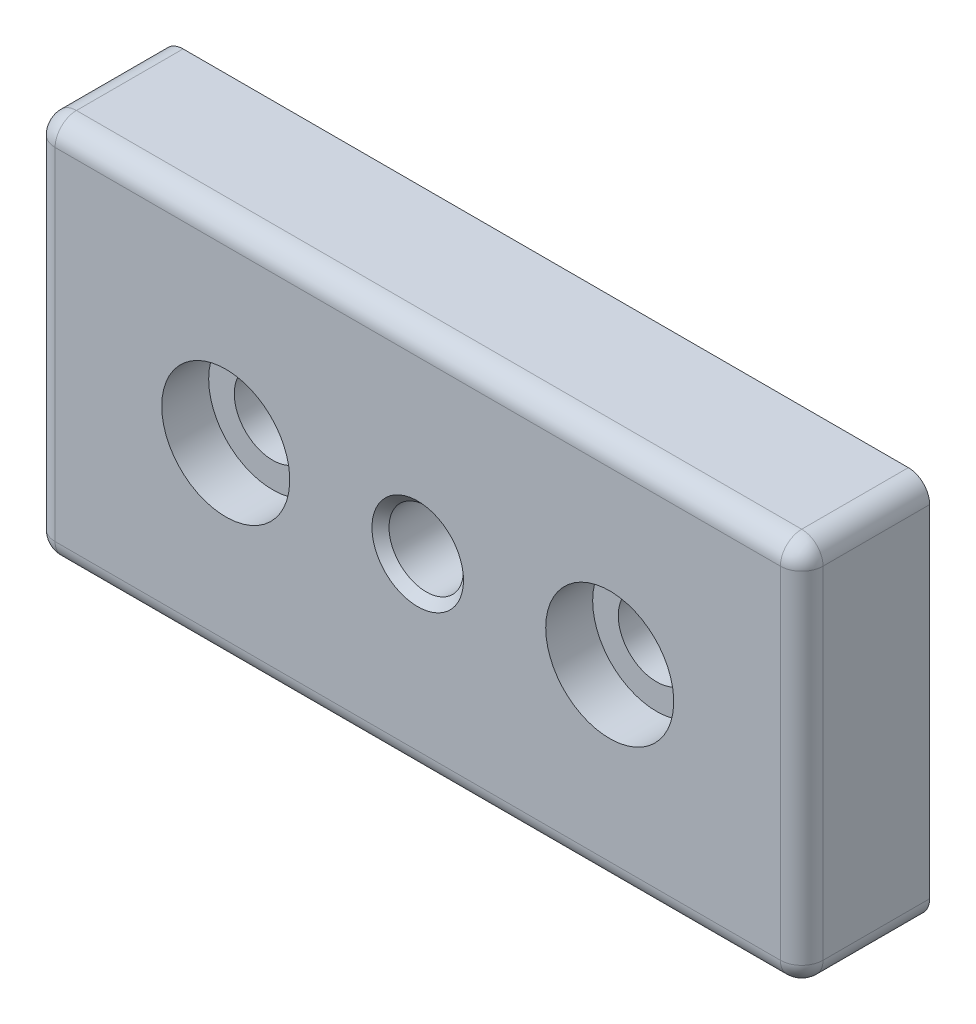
ISO-10303-21;
HEADER;
FILE_DESCRIPTION(('STEP AP214'),'2;1');
FILE_NAME('part.step','',(''),(''),'','','');
FILE_SCHEMA(('AUTOMOTIVE_DESIGN { 1 0 10303 214 1 1 1 1 }'));
ENDSEC;
DATA;
#1=APPLICATION_CONTEXT('core data for automotive mechanical design processes');
#2=APPLICATION_PROTOCOL_DEFINITION('international standard','automotive_design',2000,#1);
#3=PRODUCT_CONTEXT('',#1,'mechanical');
#4=PRODUCT('Part','Part','',(#3));
#5=PRODUCT_RELATED_PRODUCT_CATEGORY('part','',(#4));
#6=PRODUCT_DEFINITION_FORMATION('','',#4);
#7=PRODUCT_DEFINITION_CONTEXT('part definition',#1,'design');
#8=PRODUCT_DEFINITION('design','',#6,#7);
#9=PRODUCT_DEFINITION_SHAPE('','',#8);
#10=(LENGTH_UNIT() NAMED_UNIT(*) SI_UNIT(.MILLI.,.METRE.));
#11=(NAMED_UNIT(*) PLANE_ANGLE_UNIT() SI_UNIT($,.RADIAN.));
#12=(NAMED_UNIT(*) SI_UNIT($,.STERADIAN.) SOLID_ANGLE_UNIT());
#13=UNCERTAINTY_MEASURE_WITH_UNIT(LENGTH_MEASURE(1.E-05),#10,'distance_accuracy_value','');
#14=(GEOMETRIC_REPRESENTATION_CONTEXT(3) GLOBAL_UNCERTAINTY_ASSIGNED_CONTEXT((#13)) GLOBAL_UNIT_ASSIGNED_CONTEXT((#10,
#11,#12)) REPRESENTATION_CONTEXT('',''));
#15=CARTESIAN_POINT('',(0.,0.,0.));
#16=DIRECTION('',(0.,0.,1.));
#17=DIRECTION('',(1.,0.,0.));
#18=AXIS2_PLACEMENT_3D('',#15,#16,#17);
#19=CARTESIAN_POINT('',(0.,0.,15.0000000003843));
#20=DIRECTION('',(0.,0.,1.));
#21=DIRECTION('',(1.,0.,0.));
#22=AXIS2_PLACEMENT_3D('',#19,#20,#21);
#23=CONICAL_SURFACE('',#22,5.36562499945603,0.785398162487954);
#24=CARTESIAN_POINT('',(0.,0.,15.0000000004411));
#25=DIRECTION('',(0.,0.,1.));
#26=DIRECTION('',(1.,0.,0.));
#27=AXIS2_PLACEMENT_3D('',#24,#25,#26);
#28=CIRCLE('',#27,5.36562499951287);
#29=CARTESIAN_POINT('',(5.36562499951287,0.,15.0000000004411));
#30=VERTEX_POINT('',#29);
#31=EDGE_CURVE('E19',#30,#30,#28,.F.);
#32=ORIENTED_EDGE('',*,*,#31,.F.);
#33=EDGE_LOOP('',(#32));
#34=FACE_BOUND('',#33,.T.);
#35=CARTESIAN_POINT('',(0.,0.,14.));
#36=DIRECTION('',(0.,0.,1.));
#37=DIRECTION('',(1.,0.,0.));
#38=AXIS2_PLACEMENT_3D('',#35,#36,#37);
#39=CIRCLE('',#38,4.365625);
#40=CARTESIAN_POINT('',(4.365625,0.,14.));
#41=VERTEX_POINT('',#40);
#42=EDGE_CURVE('E118',#41,#41,#39,.F.);
#43=ORIENTED_EDGE('',*,*,#42,.T.);
#44=EDGE_LOOP('',(#43));
#45=FACE_BOUND('',#44,.T.);
#46=ADVANCED_FACE('F15',(#34,#45),#23,.F.);
#47=CARTESIAN_POINT('',(0.,0.,15.));
#48=DIRECTION('',(0.,0.,1.));
#49=DIRECTION('',(1.,0.,0.));
#50=AXIS2_PLACEMENT_3D('',#47,#48,#49);
#51=PLANE('',#50);
#52=ORIENTED_EDGE('',*,*,#31,.T.);
#53=EDGE_LOOP('',(#52));
#54=FACE_BOUND('',#53,.T.);
#55=CARTESIAN_POINT('',(-22.5,0.,15.));
#56=DIRECTION('',(0.,0.,-1.));
#57=DIRECTION('',(-1.,0.,0.));
#58=AXIS2_PLACEMENT_3D('',#55,#56,#57);
#59=CIRCLE('',#58,7.5);
#60=CARTESIAN_POINT('',(-30.,0.,15.));
#61=VERTEX_POINT('',#60);
#62=EDGE_CURVE('E116',#61,#61,#59,.T.);
#63=ORIENTED_EDGE('',*,*,#62,.T.);
#64=EDGE_LOOP('',(#63));
#65=FACE_BOUND('',#64,.T.);
#66=CARTESIAN_POINT('',(22.5,0.,15.));
#67=DIRECTION('',(0.,0.,-1.));
#68=DIRECTION('',(-1.,0.,0.));
#69=AXIS2_PLACEMENT_3D('',#66,#67,#68);
#70=CIRCLE('',#69,7.5);
#71=CARTESIAN_POINT('',(15.,0.,15.));
#72=VERTEX_POINT('',#71);
#73=EDGE_CURVE('E113',#72,#72,#70,.T.);
#74=ORIENTED_EDGE('',*,*,#73,.T.);
#75=EDGE_LOOP('',(#74));
#76=FACE_BOUND('',#75,.T.);
#77=DIRECTION('',(-1.,0.,0.));
#78=VECTOR('',#77,1.);
#79=CARTESIAN_POINT('',(22.5,-20.,15.));
#80=LINE('',#79,#78);
#81=CARTESIAN_POINT('',(42.5,-20.0000000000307,15.));
#82=VERTEX_POINT('',#81);
#83=CARTESIAN_POINT('',(-42.5,-20.,15.));
#84=VERTEX_POINT('',#83);
#85=EDGE_CURVE('E139',#82,#84,#80,.T.);
#86=ORIENTED_EDGE('',*,*,#85,.F.);
#87=DIRECTION('',(0.,-1.,0.));
#88=VECTOR('',#87,1.);
#89=CARTESIAN_POINT('',(42.5,11.25,15.));
#90=LINE('',#89,#88);
#91=CARTESIAN_POINT('',(42.5,20.,15.));
#92=VERTEX_POINT('',#91);
#93=EDGE_CURVE('E132',#92,#82,#90,.T.);
#94=ORIENTED_EDGE('',*,*,#93,.F.);
#95=DIRECTION('',(1.,0.,0.));
#96=VECTOR('',#95,1.);
#97=CARTESIAN_POINT('',(-22.5,20.,15.));
#98=LINE('',#97,#96);
#99=CARTESIAN_POINT('',(-42.5,20.0000000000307,15.));
#100=VERTEX_POINT('',#99);
#101=EDGE_CURVE('E115',#100,#92,#98,.T.);
#102=ORIENTED_EDGE('',*,*,#101,.F.);
#103=DIRECTION('',(0.,1.,0.));
#104=VECTOR('',#103,1.);
#105=CARTESIAN_POINT('',(-42.5,-11.25,15.));
#106=LINE('',#105,#104);
#107=EDGE_CURVE('E144',#84,#100,#106,.T.);
#108=ORIENTED_EDGE('',*,*,#107,.F.);
#109=EDGE_LOOP('',(#86,#94,#102,#108));
#110=FACE_BOUND('',#109,.T.);
#111=ADVANCED_FACE('F280',(#54,#65,#76,#110),#51,.T.);
#112=CARTESIAN_POINT('',(0.,0.,0.));
#113=DIRECTION('',(0.,0.,1.));
#114=DIRECTION('',(1.,0.,0.));
#115=AXIS2_PLACEMENT_3D('',#112,#113,#114);
#116=CYLINDRICAL_SURFACE('',#115,4.365625);
#117=ORIENTED_EDGE('',*,*,#42,.F.);
#118=EDGE_LOOP('',(#117));
#119=FACE_BOUND('',#118,.T.);
#120=CARTESIAN_POINT('',(0.,0.,0.));
#121=DIRECTION('',(0.,0.,1.));
#122=DIRECTION('',(1.,0.,0.));
#123=AXIS2_PLACEMENT_3D('',#120,#121,#122);
#124=CIRCLE('',#123,4.365625);
#125=CARTESIAN_POINT('',(4.365625,0.,0.));
#126=VERTEX_POINT('',#125);
#127=EDGE_CURVE('E109',#126,#126,#124,.F.);
#128=ORIENTED_EDGE('',*,*,#127,.T.);
#129=EDGE_LOOP('',(#128));
#130=FACE_BOUND('',#129,.T.);
#131=ADVANCED_FACE('F276',(#119,#130),#116,.F.);
#132=CARTESIAN_POINT('',(-22.5,0.,15.));
#133=DIRECTION('',(0.,0.,-1.));
#134=DIRECTION('',(-1.,0.,0.));
#135=AXIS2_PLACEMENT_3D('',#132,#133,#134);
#136=CYLINDRICAL_SURFACE('',#135,7.5);
#137=CARTESIAN_POINT('',(-22.5,0.,9.5));
#138=DIRECTION('',(0.,0.,-1.));
#139=DIRECTION('',(-1.,0.,0.));
#140=AXIS2_PLACEMENT_3D('',#137,#138,#139);
#141=CIRCLE('',#140,7.5);
#142=CARTESIAN_POINT('',(-30.,0.,9.5));
#143=VERTEX_POINT('',#142);
#144=EDGE_CURVE('E106',#143,#143,#141,.T.);
#145=ORIENTED_EDGE('',*,*,#144,.T.);
#146=EDGE_LOOP('',(#145));
#147=FACE_BOUND('',#146,.T.);
#148=ORIENTED_EDGE('',*,*,#62,.F.);
#149=EDGE_LOOP('',(#148));
#150=FACE_BOUND('',#149,.T.);
#151=ADVANCED_FACE('F279',(#147,#150),#136,.F.);
#152=CARTESIAN_POINT('',(22.5,0.,15.));
#153=DIRECTION('',(0.,0.,-1.));
#154=DIRECTION('',(-1.,0.,0.));
#155=AXIS2_PLACEMENT_3D('',#152,#153,#154);
#156=CYLINDRICAL_SURFACE('',#155,7.5);
#157=CARTESIAN_POINT('',(22.5,0.,9.5));
#158=DIRECTION('',(0.,0.,-1.));
#159=DIRECTION('',(-1.,0.,0.));
#160=AXIS2_PLACEMENT_3D('',#157,#158,#159);
#161=CIRCLE('',#160,7.5);
#162=CARTESIAN_POINT('',(15.,0.,9.5));
#163=VERTEX_POINT('',#162);
#164=EDGE_CURVE('E102',#163,#163,#161,.T.);
#165=ORIENTED_EDGE('',*,*,#164,.T.);
#166=EDGE_LOOP('',(#165));
#167=FACE_BOUND('',#166,.T.);
#168=ORIENTED_EDGE('',*,*,#73,.F.);
#169=EDGE_LOOP('',(#168));
#170=FACE_BOUND('',#169,.T.);
#171=ADVANCED_FACE('F274',(#167,#170),#156,.F.);
#172=CARTESIAN_POINT('',(-22.5,20.,12.5));
#173=DIRECTION('',(1.,0.,0.));
#174=DIRECTION('',(0.,1.,0.));
#175=AXIS2_PLACEMENT_3D('',#172,#173,#174);
#176=CYLINDRICAL_SURFACE('',#175,2.5);
#177=CARTESIAN_POINT('',(-42.5,20.,12.5));
#178=DIRECTION('',(1.,0.,0.));
#179=DIRECTION('',(0.,1.,0.));
#180=AXIS2_PLACEMENT_3D('',#177,#178,#179);
#181=CIRCLE('',#180,2.5);
#182=CARTESIAN_POINT('',(-42.5,22.5,12.5));
#183=VERTEX_POINT('',#182);
#184=EDGE_CURVE('E128',#100,#183,#181,.F.);
#185=ORIENTED_EDGE('',*,*,#184,.F.);
#186=ORIENTED_EDGE('',*,*,#101,.T.);
#187=CARTESIAN_POINT('',(42.5,20.,12.5));
#188=DIRECTION('',(1.,0.,0.));
#189=DIRECTION('',(0.,1.,0.));
#190=AXIS2_PLACEMENT_3D('',#187,#188,#189);
#191=CIRCLE('',#190,2.5);
#192=CARTESIAN_POINT('',(42.5,22.5,12.5));
#193=VERTEX_POINT('',#192);
#194=EDGE_CURVE('E135',#193,#92,#191,.T.);
#195=ORIENTED_EDGE('',*,*,#194,.F.);
#196=DIRECTION('',(1.,0.,0.));
#197=VECTOR('',#196,1.);
#198=CARTESIAN_POINT('',(-45.,22.5,12.5));
#199=LINE('',#198,#197);
#200=EDGE_CURVE('E105',#183,#193,#199,.T.);
#201=ORIENTED_EDGE('',*,*,#200,.F.);
#202=EDGE_LOOP('',(#185,#186,#195,#201));
#203=FACE_BOUND('',#202,.T.);
#204=ADVANCED_FACE('F270',(#203),#176,.T.);
#205=CARTESIAN_POINT('',(-42.5,20.,12.5));
#206=DIRECTION('',(1.,0.,0.));
#207=DIRECTION('',(0.,1.,0.));
#208=AXIS2_PLACEMENT_3D('',#205,#206,#207);
#209=SPHERICAL_SURFACE('',#208,2.5);
#210=ORIENTED_EDGE('',*,*,#184,.T.);
#211=CARTESIAN_POINT('',(-42.5,20.,12.5));
#212=DIRECTION('',(0.,0.,1.));
#213=DIRECTION('',(1.,0.,0.));
#214=AXIS2_PLACEMENT_3D('',#211,#212,#213);
#215=CIRCLE('',#214,2.5);
#216=CARTESIAN_POINT('',(-45.,20.,12.5));
#217=VERTEX_POINT('',#216);
#218=EDGE_CURVE('E228',#217,#183,#215,.F.);
#219=ORIENTED_EDGE('',*,*,#218,.F.);
#220=CARTESIAN_POINT('',(-42.5,20.,12.5));
#221=DIRECTION('',(0.,1.,0.));
#222=DIRECTION('',(-1.,0.,0.));
#223=AXIS2_PLACEMENT_3D('',#220,#221,#222);
#224=CIRCLE('',#223,2.5);
#225=EDGE_CURVE('E147',#100,#217,#224,.F.);
#226=ORIENTED_EDGE('',*,*,#225,.F.);
#227=EDGE_LOOP('',(#210,#219,#226));
#228=FACE_BOUND('',#227,.T.);
#229=ADVANCED_FACE('F267',(#228),#209,.T.);
#230=CARTESIAN_POINT('',(-42.5,-11.25,12.5));
#231=DIRECTION('',(0.,1.,0.));
#232=DIRECTION('',(-1.,0.,0.));
#233=AXIS2_PLACEMENT_3D('',#230,#231,#232);
#234=CYLINDRICAL_SURFACE('',#233,2.5);
#235=CARTESIAN_POINT('',(-42.5,-20.,12.5));
#236=DIRECTION('',(0.,-1.,0.));
#237=DIRECTION('',(1.,0.,0.));
#238=AXIS2_PLACEMENT_3D('',#235,#236,#237);
#239=CIRCLE('',#238,2.5);
#240=CARTESIAN_POINT('',(-45.,-20.,12.5));
#241=VERTEX_POINT('',#240);
#242=EDGE_CURVE('E146',#84,#241,#239,.T.);
#243=ORIENTED_EDGE('',*,*,#242,.F.);
#244=ORIENTED_EDGE('',*,*,#107,.T.);
#245=ORIENTED_EDGE('',*,*,#225,.T.);
#246=DIRECTION('',(0.,1.,0.));
#247=VECTOR('',#246,1.);
#248=CARTESIAN_POINT('',(-45.,-22.5,12.5));
#249=LINE('',#248,#247);
#250=EDGE_CURVE('E74',#241,#217,#249,.T.);
#251=ORIENTED_EDGE('',*,*,#250,.F.);
#252=EDGE_LOOP('',(#243,#244,#245,#251));
#253=FACE_BOUND('',#252,.T.);
#254=ADVANCED_FACE('F255',(#253),#234,.T.);
#255=CARTESIAN_POINT('',(-42.5,-20.,12.5));
#256=DIRECTION('',(1.,0.,0.));
#257=DIRECTION('',(0.,1.,0.));
#258=AXIS2_PLACEMENT_3D('',#255,#256,#257);
#259=SPHERICAL_SURFACE('',#258,2.5);
#260=ORIENTED_EDGE('',*,*,#242,.T.);
#261=CARTESIAN_POINT('',(-42.5,-20.,12.5));
#262=DIRECTION('',(0.,0.,1.));
#263=DIRECTION('',(1.,0.,0.));
#264=AXIS2_PLACEMENT_3D('',#261,#262,#263);
#265=CIRCLE('',#264,2.5);
#266=CARTESIAN_POINT('',(-42.5,-22.5,12.5));
#267=VERTEX_POINT('',#266);
#268=EDGE_CURVE('E456',#267,#241,#265,.F.);
#269=ORIENTED_EDGE('',*,*,#268,.F.);
#270=CARTESIAN_POINT('',(-42.5,-20.,12.5));
#271=DIRECTION('',(-1.,0.,0.));
#272=DIRECTION('',(0.,0.,1.));
#273=AXIS2_PLACEMENT_3D('',#270,#271,#272);
#274=CIRCLE('',#273,2.5);
#275=EDGE_CURVE('E143',#84,#267,#274,.F.);
#276=ORIENTED_EDGE('',*,*,#275,.F.);
#277=EDGE_LOOP('',(#260,#269,#276));
#278=FACE_BOUND('',#277,.T.);
#279=ADVANCED_FACE('F250',(#278),#259,.T.);
#280=CARTESIAN_POINT('',(22.5,-20.,12.5));
#281=DIRECTION('',(-1.,0.,0.));
#282=DIRECTION('',(0.,0.,1.));
#283=AXIS2_PLACEMENT_3D('',#280,#281,#282);
#284=CYLINDRICAL_SURFACE('',#283,2.5);
#285=CARTESIAN_POINT('',(42.5,-20.,12.5));
#286=DIRECTION('',(1.,0.,0.));
#287=DIRECTION('',(0.,1.,0.));
#288=AXIS2_PLACEMENT_3D('',#285,#286,#287);
#289=CIRCLE('',#288,2.5);
#290=CARTESIAN_POINT('',(42.5,-22.5,12.5));
#291=VERTEX_POINT('',#290);
#292=EDGE_CURVE('E142',#82,#291,#289,.T.);
#293=ORIENTED_EDGE('',*,*,#292,.F.);
#294=ORIENTED_EDGE('',*,*,#85,.T.);
#295=ORIENTED_EDGE('',*,*,#275,.T.);
#296=DIRECTION('',(1.,0.,0.));
#297=VECTOR('',#296,1.);
#298=CARTESIAN_POINT('',(45.,-22.5,12.5));
#299=LINE('',#298,#297);
#300=EDGE_CURVE('E236',#291,#267,#299,.F.);
#301=ORIENTED_EDGE('',*,*,#300,.F.);
#302=EDGE_LOOP('',(#293,#294,#295,#301));
#303=FACE_BOUND('',#302,.T.);
#304=ADVANCED_FACE('F246',(#303),#284,.T.);
#305=CARTESIAN_POINT('',(42.5,-20.,12.5));
#306=DIRECTION('',(1.,0.,0.));
#307=DIRECTION('',(0.,1.,0.));
#308=AXIS2_PLACEMENT_3D('',#305,#306,#307);
#309=SPHERICAL_SURFACE('',#308,2.5);
#310=CARTESIAN_POINT('',(42.5,-20.,12.5));
#311=DIRECTION('',(0.,-1.,0.));
#312=DIRECTION('',(1.,0.,0.));
#313=AXIS2_PLACEMENT_3D('',#310,#311,#312);
#314=CIRCLE('',#313,2.5);
#315=CARTESIAN_POINT('',(45.,-20.,12.5));
#316=VERTEX_POINT('',#315);
#317=EDGE_CURVE('E136',#82,#316,#314,.F.);
#318=ORIENTED_EDGE('',*,*,#317,.F.);
#319=ORIENTED_EDGE('',*,*,#292,.T.);
#320=CARTESIAN_POINT('',(42.5,-20.,12.5));
#321=DIRECTION('',(0.,0.,1.));
#322=DIRECTION('',(1.,0.,0.));
#323=AXIS2_PLACEMENT_3D('',#320,#321,#322);
#324=CIRCLE('',#323,2.5);
#325=EDGE_CURVE('E229',#316,#291,#324,.F.);
#326=ORIENTED_EDGE('',*,*,#325,.F.);
#327=EDGE_LOOP('',(#318,#319,#326));
#328=FACE_BOUND('',#327,.T.);
#329=ADVANCED_FACE('F243',(#328),#309,.T.);
#330=CARTESIAN_POINT('',(42.5,11.25,12.5));
#331=DIRECTION('',(0.,-1.,0.));
#332=DIRECTION('',(1.,0.,0.));
#333=AXIS2_PLACEMENT_3D('',#330,#331,#332);
#334=CYLINDRICAL_SURFACE('',#333,2.5);
#335=CARTESIAN_POINT('',(42.5,20.,12.5));
#336=DIRECTION('',(0.,-1.,0.));
#337=DIRECTION('',(1.,0.,0.));
#338=AXIS2_PLACEMENT_3D('',#335,#336,#337);
#339=CIRCLE('',#338,2.5);
#340=CARTESIAN_POINT('',(45.,20.,12.5));
#341=VERTEX_POINT('',#340);
#342=EDGE_CURVE('E112',#92,#341,#339,.F.);
#343=ORIENTED_EDGE('',*,*,#342,.F.);
#344=ORIENTED_EDGE('',*,*,#93,.T.);
#345=ORIENTED_EDGE('',*,*,#317,.T.);
#346=DIRECTION('',(0.,1.,0.));
#347=VECTOR('',#346,1.);
#348=CARTESIAN_POINT('',(45.,22.5,12.5));
#349=LINE('',#348,#347);
#350=EDGE_CURVE('E462',#341,#316,#349,.F.);
#351=ORIENTED_EDGE('',*,*,#350,.F.);
#352=EDGE_LOOP('',(#343,#344,#345,#351));
#353=FACE_BOUND('',#352,.T.);
#354=ADVANCED_FACE('F214',(#353),#334,.T.);
#355=CARTESIAN_POINT('',(42.5,20.,12.5));
#356=DIRECTION('',(1.,0.,0.));
#357=DIRECTION('',(0.,1.,0.));
#358=AXIS2_PLACEMENT_3D('',#355,#356,#357);
#359=SPHERICAL_SURFACE('',#358,2.5);
#360=ORIENTED_EDGE('',*,*,#194,.T.);
#361=ORIENTED_EDGE('',*,*,#342,.T.);
#362=CARTESIAN_POINT('',(42.5,20.,12.5));
#363=DIRECTION('',(0.,0.,1.));
#364=DIRECTION('',(1.,0.,0.));
#365=AXIS2_PLACEMENT_3D('',#362,#363,#364);
#366=CIRCLE('',#365,2.5);
#367=EDGE_CURVE('E220',#193,#341,#366,.F.);
#368=ORIENTED_EDGE('',*,*,#367,.F.);
#369=EDGE_LOOP('',(#360,#361,#368));
#370=FACE_BOUND('',#369,.T.);
#371=ADVANCED_FACE('F209',(#370),#359,.T.);
#372=CARTESIAN_POINT('',(0.,0.,0.));
#373=DIRECTION('',(0.,0.,1.));
#374=DIRECTION('',(1.,0.,0.));
#375=AXIS2_PLACEMENT_3D('',#372,#373,#374);
#376=PLANE('',#375);
#377=ORIENTED_EDGE('',*,*,#127,.F.);
#378=EDGE_LOOP('',(#377));
#379=FACE_BOUND('',#378,.T.);
#380=CARTESIAN_POINT('',(0.,0.,0.));
#381=DIRECTION('',(0.,0.,-1.));
#382=DIRECTION('',(-1.,0.,0.));
#383=AXIS2_PLACEMENT_3D('',#380,#381,#382);
#384=CIRCLE('',#383,8.3);
#385=CARTESIAN_POINT('',(-8.3,0.,0.));
#386=VERTEX_POINT('',#385);
#387=EDGE_CURVE('E99',#386,#386,#384,.T.);
#388=ORIENTED_EDGE('',*,*,#387,.T.);
#389=EDGE_LOOP('',(#388));
#390=FACE_BOUND('',#389,.T.);
#391=ADVANCED_FACE('F205',(#379,#390),#376,.F.);
#392=CARTESIAN_POINT('',(-30.15,7.65,9.5));
#393=DIRECTION('',(0.,0.,-1.));
#394=DIRECTION('',(1.,0.,0.));
#395=AXIS2_PLACEMENT_3D('',#392,#393,#394);
#396=PLANE('',#395);
#397=CARTESIAN_POINT('',(-22.5,0.,9.5));
#398=DIRECTION('',(0.,0.,1.));
#399=DIRECTION('',(1.,0.,0.));
#400=AXIS2_PLACEMENT_3D('',#397,#398,#399);
#401=CIRCLE('',#400,4.5);
#402=CARTESIAN_POINT('',(-18.,0.,9.5));
#403=VERTEX_POINT('',#402);
#404=EDGE_CURVE('E96',#403,#403,#401,.F.);
#405=ORIENTED_EDGE('',*,*,#404,.T.);
#406=EDGE_LOOP('',(#405));
#407=FACE_BOUND('',#406,.T.);
#408=ORIENTED_EDGE('',*,*,#144,.F.);
#409=EDGE_LOOP('',(#408));
#410=FACE_BOUND('',#409,.T.);
#411=ADVANCED_FACE('F208',(#407,#410),#396,.F.);
#412=CARTESIAN_POINT('',(14.85,7.65,9.5));
#413=DIRECTION('',(0.,0.,-1.));
#414=DIRECTION('',(1.,0.,0.));
#415=AXIS2_PLACEMENT_3D('',#412,#413,#414);
#416=PLANE('',#415);
#417=CARTESIAN_POINT('',(22.5,0.,9.5));
#418=DIRECTION('',(0.,0.,1.));
#419=DIRECTION('',(1.,0.,0.));
#420=AXIS2_PLACEMENT_3D('',#417,#418,#419);
#421=CIRCLE('',#420,4.5);
#422=CARTESIAN_POINT('',(27.,0.,9.5));
#423=VERTEX_POINT('',#422);
#424=EDGE_CURVE('E89',#423,#423,#421,.F.);
#425=ORIENTED_EDGE('',*,*,#424,.T.);
#426=EDGE_LOOP('',(#425));
#427=FACE_BOUND('',#426,.T.);
#428=ORIENTED_EDGE('',*,*,#164,.F.);
#429=EDGE_LOOP('',(#428));
#430=FACE_BOUND('',#429,.T.);
#431=ADVANCED_FACE('F17',(#427,#430),#416,.F.);
#432=CARTESIAN_POINT('',(-45.,22.5,0.));
#433=DIRECTION('',(0.,1.,0.));
#434=DIRECTION('',(0.,0.,1.));
#435=AXIS2_PLACEMENT_3D('',#432,#433,#434);
#436=PLANE('',#435);
#437=DIRECTION('',(0.,0.,1.));
#438=VECTOR('',#437,1.);
#439=CARTESIAN_POINT('',(-42.5,22.5,0.));
#440=LINE('',#439,#438);
#441=CARTESIAN_POINT('',(-42.5,22.5,0.));
#442=VERTEX_POINT('',#441);
#443=EDGE_CURVE('E60',#183,#442,#440,.F.);
#444=ORIENTED_EDGE('',*,*,#443,.F.);
#445=ORIENTED_EDGE('',*,*,#200,.T.);
#446=DIRECTION('',(0.,0.,1.));
#447=VECTOR('',#446,1.);
#448=CARTESIAN_POINT('',(42.5,22.5,0.));
#449=LINE('',#448,#447);
#450=CARTESIAN_POINT('',(42.5,22.5,0.));
#451=VERTEX_POINT('',#450);
#452=EDGE_CURVE('E468',#451,#193,#449,.T.);
#453=ORIENTED_EDGE('',*,*,#452,.F.);
#454=DIRECTION('',(1.,0.,0.));
#455=VECTOR('',#454,1.);
#456=CARTESIAN_POINT('',(0.,22.5,0.));
#457=LINE('',#456,#455);
#458=EDGE_CURVE('E87',#451,#442,#457,.F.);
#459=ORIENTED_EDGE('',*,*,#458,.T.);
#460=EDGE_LOOP('',(#444,#445,#453,#459));
#461=FACE_BOUND('',#460,.T.);
#462=ADVANCED_FACE('F201',(#461),#436,.T.);
#463=CARTESIAN_POINT('',(-42.5,20.,0.));
#464=DIRECTION('',(0.,0.,1.));
#465=DIRECTION('',(1.,0.,0.));
#466=AXIS2_PLACEMENT_3D('',#463,#464,#465);
#467=CYLINDRICAL_SURFACE('',#466,2.5);
#468=ORIENTED_EDGE('',*,*,#218,.T.);
#469=ORIENTED_EDGE('',*,*,#443,.T.);
#470=CARTESIAN_POINT('',(-42.5,20.,0.));
#471=DIRECTION('',(0.,0.,1.));
#472=DIRECTION('',(1.,0.,0.));
#473=AXIS2_PLACEMENT_3D('',#470,#471,#472);
#474=CIRCLE('',#473,2.5);
#475=CARTESIAN_POINT('',(-45.,20.,0.));
#476=VERTEX_POINT('',#475);
#477=EDGE_CURVE('E80',#442,#476,#474,.T.);
#478=ORIENTED_EDGE('',*,*,#477,.T.);
#479=DIRECTION('',(0.,0.,1.));
#480=VECTOR('',#479,1.);
#481=CARTESIAN_POINT('',(-45.,20.,0.));
#482=LINE('',#481,#480);
#483=EDGE_CURVE('E67',#217,#476,#482,.F.);
#484=ORIENTED_EDGE('',*,*,#483,.F.);
#485=EDGE_LOOP('',(#468,#469,#478,#484));
#486=FACE_BOUND('',#485,.T.);
#487=ADVANCED_FACE('F86',(#486),#467,.T.);
#488=CARTESIAN_POINT('',(-45.,-22.5,0.));
#489=DIRECTION('',(-1.,0.,0.));
#490=DIRECTION('',(0.,0.,1.));
#491=AXIS2_PLACEMENT_3D('',#488,#489,#490);
#492=PLANE('',#491);
#493=DIRECTION('',(0.,0.,1.));
#494=VECTOR('',#493,1.);
#495=CARTESIAN_POINT('',(-45.,-20.,0.));
#496=LINE('',#495,#494);
#497=CARTESIAN_POINT('',(-45.,-20.,0.));
#498=VERTEX_POINT('',#497);
#499=EDGE_CURVE('E239',#241,#498,#496,.F.);
#500=ORIENTED_EDGE('',*,*,#499,.F.);
#501=ORIENTED_EDGE('',*,*,#250,.T.);
#502=ORIENTED_EDGE('',*,*,#483,.T.);
#503=DIRECTION('',(0.,1.,0.));
#504=VECTOR('',#503,1.);
#505=CARTESIAN_POINT('',(-45.,0.,0.));
#506=LINE('',#505,#504);
#507=EDGE_CURVE('E71',#476,#498,#506,.F.);
#508=ORIENTED_EDGE('',*,*,#507,.T.);
#509=EDGE_LOOP('',(#500,#501,#502,#508));
#510=FACE_BOUND('',#509,.T.);
#511=ADVANCED_FACE('F70',(#510),#492,.T.);
#512=CARTESIAN_POINT('',(-42.5,-20.,0.));
#513=DIRECTION('',(0.,0.,1.));
#514=DIRECTION('',(1.,0.,0.));
#515=AXIS2_PLACEMENT_3D('',#512,#513,#514);
#516=CYLINDRICAL_SURFACE('',#515,2.5);
#517=ORIENTED_EDGE('',*,*,#268,.T.);
#518=ORIENTED_EDGE('',*,*,#499,.T.);
#519=CARTESIAN_POINT('',(-42.5,-20.,0.));
#520=DIRECTION('',(0.,0.,1.));
#521=DIRECTION('',(1.,0.,0.));
#522=AXIS2_PLACEMENT_3D('',#519,#520,#521);
#523=CIRCLE('',#522,2.5);
#524=CARTESIAN_POINT('',(-42.5,-22.5,0.));
#525=VERTEX_POINT('',#524);
#526=EDGE_CURVE('E84',#498,#525,#523,.T.);
#527=ORIENTED_EDGE('',*,*,#526,.T.);
#528=DIRECTION('',(0.,0.,-1.));
#529=VECTOR('',#528,1.);
#530=CARTESIAN_POINT('',(-42.5,-22.5,0.));
#531=LINE('',#530,#529);
#532=EDGE_CURVE('E233',#267,#525,#531,.T.);
#533=ORIENTED_EDGE('',*,*,#532,.F.);
#534=EDGE_LOOP('',(#517,#518,#527,#533));
#535=FACE_BOUND('',#534,.T.);
#536=ADVANCED_FACE('F193',(#535),#516,.T.);
#537=CARTESIAN_POINT('',(45.,-22.5,0.));
#538=DIRECTION('',(0.,-1.,0.));
#539=DIRECTION('',(0.,0.,-1.));
#540=AXIS2_PLACEMENT_3D('',#537,#538,#539);
#541=PLANE('',#540);
#542=ORIENTED_EDGE('',*,*,#532,.T.);
#543=DIRECTION('',(1.,0.,0.));
#544=VECTOR('',#543,1.);
#545=CARTESIAN_POINT('',(0.,-22.5,0.));
#546=LINE('',#545,#544);
#547=CARTESIAN_POINT('',(42.5,-22.5,0.));
#548=VERTEX_POINT('',#547);
#549=EDGE_CURVE('E158',#525,#548,#546,.T.);
#550=ORIENTED_EDGE('',*,*,#549,.T.);
#551=DIRECTION('',(0.,0.,1.));
#552=VECTOR('',#551,1.);
#553=CARTESIAN_POINT('',(42.5,-22.5,0.));
#554=LINE('',#553,#552);
#555=EDGE_CURVE('E232',#291,#548,#554,.F.);
#556=ORIENTED_EDGE('',*,*,#555,.F.);
#557=ORIENTED_EDGE('',*,*,#300,.T.);
#558=EDGE_LOOP('',(#542,#550,#556,#557));
#559=FACE_BOUND('',#558,.T.);
#560=ADVANCED_FACE('F190',(#559),#541,.T.);
#561=CARTESIAN_POINT('',(42.5,-20.,0.));
#562=DIRECTION('',(0.,0.,1.));
#563=DIRECTION('',(1.,0.,0.));
#564=AXIS2_PLACEMENT_3D('',#561,#562,#563);
#565=CYLINDRICAL_SURFACE('',#564,2.5);
#566=ORIENTED_EDGE('',*,*,#325,.T.);
#567=ORIENTED_EDGE('',*,*,#555,.T.);
#568=CARTESIAN_POINT('',(42.5,-20.,0.));
#569=DIRECTION('',(0.,0.,1.));
#570=DIRECTION('',(1.,0.,0.));
#571=AXIS2_PLACEMENT_3D('',#568,#569,#570);
#572=CIRCLE('',#571,2.5);
#573=CARTESIAN_POINT('',(45.,-20.,0.));
#574=VERTEX_POINT('',#573);
#575=EDGE_CURVE('E156',#548,#574,#572,.T.);
#576=ORIENTED_EDGE('',*,*,#575,.T.);
#577=DIRECTION('',(0.,0.,-1.));
#578=VECTOR('',#577,1.);
#579=CARTESIAN_POINT('',(45.,-20.,0.));
#580=LINE('',#579,#578);
#581=EDGE_CURVE('E464',#316,#574,#580,.T.);
#582=ORIENTED_EDGE('',*,*,#581,.F.);
#583=EDGE_LOOP('',(#566,#567,#576,#582));
#584=FACE_BOUND('',#583,.T.);
#585=ADVANCED_FACE('F186',(#584),#565,.T.);
#586=CARTESIAN_POINT('',(45.,22.5,0.));
#587=DIRECTION('',(1.,0.,0.));
#588=DIRECTION('',(0.,0.,-1.));
#589=AXIS2_PLACEMENT_3D('',#586,#587,#588);
#590=PLANE('',#589);
#591=ORIENTED_EDGE('',*,*,#581,.T.);
#592=DIRECTION('',(0.,1.,0.));
#593=VECTOR('',#592,1.);
#594=CARTESIAN_POINT('',(45.,0.,0.));
#595=LINE('',#594,#593);
#596=CARTESIAN_POINT('',(45.,20.,0.));
#597=VERTEX_POINT('',#596);
#598=EDGE_CURVE('E155',#574,#597,#595,.T.);
#599=ORIENTED_EDGE('',*,*,#598,.T.);
#600=DIRECTION('',(0.,0.,1.));
#601=VECTOR('',#600,1.);
#602=CARTESIAN_POINT('',(45.,20.,0.));
#603=LINE('',#602,#601);
#604=EDGE_CURVE('E34',#341,#597,#603,.F.);
#605=ORIENTED_EDGE('',*,*,#604,.F.);
#606=ORIENTED_EDGE('',*,*,#350,.T.);
#607=EDGE_LOOP('',(#591,#599,#605,#606));
#608=FACE_BOUND('',#607,.T.);
#609=ADVANCED_FACE('F183',(#608),#590,.T.);
#610=CARTESIAN_POINT('',(42.5,20.,0.));
#611=DIRECTION('',(0.,0.,1.));
#612=DIRECTION('',(1.,0.,0.));
#613=AXIS2_PLACEMENT_3D('',#610,#611,#612);
#614=CYLINDRICAL_SURFACE('',#613,2.5);
#615=ORIENTED_EDGE('',*,*,#367,.T.);
#616=ORIENTED_EDGE('',*,*,#604,.T.);
#617=CARTESIAN_POINT('',(42.5,20.,0.));
#618=DIRECTION('',(0.,0.,1.));
#619=DIRECTION('',(1.,0.,0.));
#620=AXIS2_PLACEMENT_3D('',#617,#618,#619);
#621=CIRCLE('',#620,2.5);
#622=EDGE_CURVE('E154',#597,#451,#621,.T.);
#623=ORIENTED_EDGE('',*,*,#622,.T.);
#624=ORIENTED_EDGE('',*,*,#452,.T.);
#625=EDGE_LOOP('',(#615,#616,#623,#624));
#626=FACE_BOUND('',#625,.T.);
#627=ADVANCED_FACE('F178',(#626),#614,.T.);
#628=CARTESIAN_POINT('',(0.,0.,0.));
#629=DIRECTION('',(0.,0.,-1.));
#630=DIRECTION('',(-1.,0.,0.));
#631=AXIS2_PLACEMENT_3D('',#628,#629,#630);
#632=TOROIDAL_SURFACE('',#631,9.5,1.2);
#633=CARTESIAN_POINT('',(0.,0.,0.));
#634=DIRECTION('',(0.,0.,-1.));
#635=DIRECTION('',(-1.,0.,0.));
#636=AXIS2_PLACEMENT_3D('',#633,#634,#635);
#637=CIRCLE('',#636,10.7);
#638=CARTESIAN_POINT('',(-10.7,0.,0.));
#639=VERTEX_POINT('',#638);
#640=EDGE_CURVE('E151',#639,#639,#637,.T.);
#641=ORIENTED_EDGE('',*,*,#640,.T.);
#642=EDGE_LOOP('',(#641));
#643=FACE_BOUND('',#642,.T.);
#644=ORIENTED_EDGE('',*,*,#387,.F.);
#645=EDGE_LOOP('',(#644));
#646=FACE_BOUND('',#645,.T.);
#647=ADVANCED_FACE('F173',(#643,#646),#632,.F.);
#648=CARTESIAN_POINT('',(-22.5,0.,0.));
#649=DIRECTION('',(0.,0.,1.));
#650=DIRECTION('',(1.,0.,0.));
#651=AXIS2_PLACEMENT_3D('',#648,#649,#650);
#652=CYLINDRICAL_SURFACE('',#651,4.5);
#653=CARTESIAN_POINT('',(-22.5,0.,0.));
#654=DIRECTION('',(0.,0.,1.));
#655=DIRECTION('',(1.,0.,0.));
#656=AXIS2_PLACEMENT_3D('',#653,#654,#655);
#657=CIRCLE('',#656,4.5);
#658=CARTESIAN_POINT('',(-18.,0.,0.));
#659=VERTEX_POINT('',#658);
#660=EDGE_CURVE('E25',#659,#659,#657,.F.);
#661=ORIENTED_EDGE('',*,*,#660,.T.);
#662=EDGE_LOOP('',(#661));
#663=FACE_BOUND('',#662,.T.);
#664=ORIENTED_EDGE('',*,*,#404,.F.);
#665=EDGE_LOOP('',(#664));
#666=FACE_BOUND('',#665,.T.);
#667=ADVANCED_FACE('F177',(#663,#666),#652,.F.);
#668=CARTESIAN_POINT('',(22.5,0.,0.));
#669=DIRECTION('',(0.,0.,1.));
#670=DIRECTION('',(1.,0.,0.));
#671=AXIS2_PLACEMENT_3D('',#668,#669,#670);
#672=CYLINDRICAL_SURFACE('',#671,4.5);
#673=CARTESIAN_POINT('',(22.5,0.,0.));
#674=DIRECTION('',(0.,0.,1.));
#675=DIRECTION('',(1.,0.,0.));
#676=AXIS2_PLACEMENT_3D('',#673,#674,#675);
#677=CIRCLE('',#676,4.5);
#678=CARTESIAN_POINT('',(27.,0.,0.));
#679=VERTEX_POINT('',#678);
#680=EDGE_CURVE('E10',#679,#679,#677,.F.);
#681=ORIENTED_EDGE('',*,*,#680,.T.);
#682=EDGE_LOOP('',(#681));
#683=FACE_BOUND('',#682,.T.);
#684=ORIENTED_EDGE('',*,*,#424,.F.);
#685=EDGE_LOOP('',(#684));
#686=FACE_BOUND('',#685,.T.);
#687=ADVANCED_FACE('F302',(#683,#686),#672,.F.);
#688=CARTESIAN_POINT('',(0.,0.,0.));
#689=DIRECTION('',(0.,0.,1.));
#690=DIRECTION('',(1.,0.,0.));
#691=AXIS2_PLACEMENT_3D('',#688,#689,#690);
#692=PLANE('',#691);
#693=ORIENTED_EDGE('',*,*,#680,.F.);
#694=EDGE_LOOP('',(#693));
#695=FACE_BOUND('',#694,.T.);
#696=ORIENTED_EDGE('',*,*,#660,.F.);
#697=EDGE_LOOP('',(#696));
#698=FACE_BOUND('',#697,.T.);
#699=ORIENTED_EDGE('',*,*,#640,.F.);
#700=EDGE_LOOP('',(#699));
#701=FACE_BOUND('',#700,.T.);
#702=ORIENTED_EDGE('',*,*,#598,.F.);
#703=ORIENTED_EDGE('',*,*,#575,.F.);
#704=ORIENTED_EDGE('',*,*,#549,.F.);
#705=ORIENTED_EDGE('',*,*,#526,.F.);
#706=ORIENTED_EDGE('',*,*,#507,.F.);
#707=ORIENTED_EDGE('',*,*,#477,.F.);
#708=ORIENTED_EDGE('',*,*,#458,.F.);
#709=ORIENTED_EDGE('',*,*,#622,.F.);
#710=EDGE_LOOP('',(#702,#703,#704,#705,#706,#707,#708,#709));
#711=FACE_BOUND('',#710,.T.);
#712=ADVANCED_FACE('F79',(#695,#698,#701,#711),#692,.F.);
#713=CLOSED_SHELL('',(#46,#111,#131,#151,#171,#204,#229,#254,#279,#304,#329,#354,#371,#391,#411,
#431,#462,#487,#511,#536,#560,#585,#609,#627,#647,#667,#687,#712));
#714=MANIFOLD_SOLID_BREP('B1',#713);
#715=ADVANCED_BREP_SHAPE_REPRESENTATION('',(#18,#714),#14);
#716=SHAPE_DEFINITION_REPRESENTATION(#9,#715);
ENDSEC;
END-ISO-10303-21;
